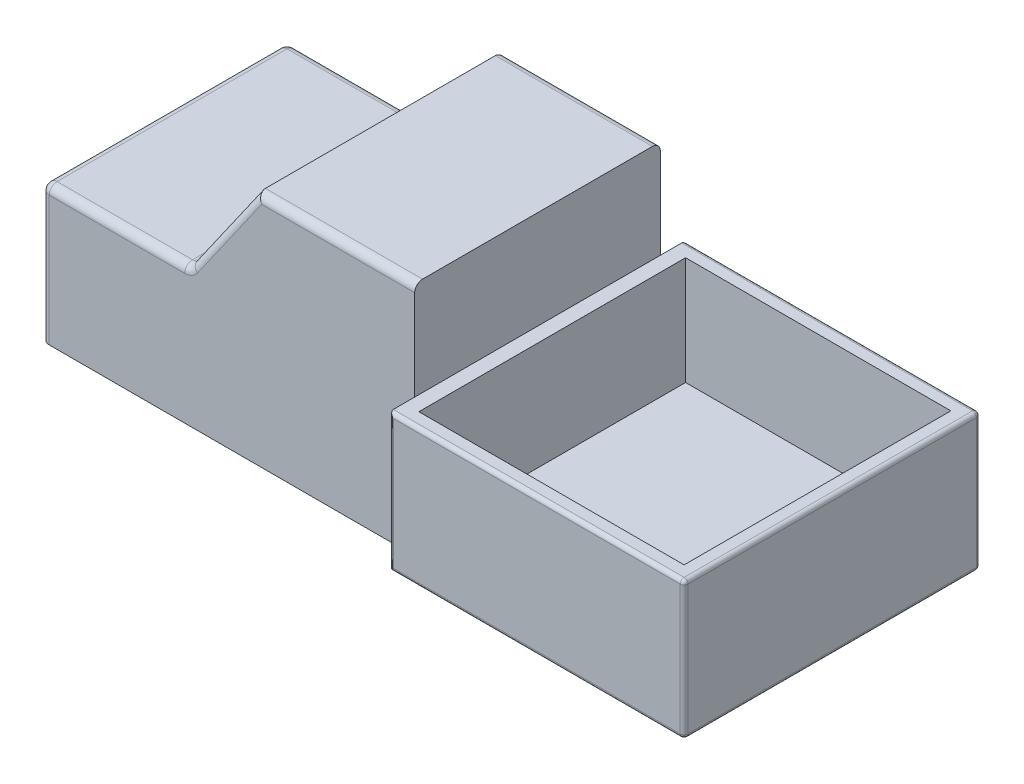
from build123d import *

# Parameters (mm, degrees)
BOSS_EXTRUDE1_DEPTH = 158.75
SKETCH6_W           = 330.2
SKETCH6_H           = 177.8
BOSS_EXTRUDE3_DEPTH = 32.7
FILLET4_R           = 10.16
SKETCH10_W          = 382.9
SKETCH10_H          = 177.8
BOSS_EXTRUDE5_DEPTH = 50.8
SKETCH11_W          = 342.9
SKETCH11_H          = 344.8
CUT_EXTRUDE2_DEPTH  = 139.7
FILLET13_R          = 5.08


with BuildPart() as part:
    # Sketch1 → Boss-Extrude1 (new, symmetric)
    with BuildSketch(Plane.XY):
        Polygon((-406.4, 88.9), (-406.4, -88.9), (406.4, -88.9), (406.4, 88.9), (76.2, 88.9), (76.2, 215.9), (-126.973642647, 215.9), (-215.9, 88.9), align=None)
    extrude(amount=BOSS_EXTRUDE1_DEPTH, both=True)

    # Sketch6 → Boss-Extrude3 (add)
    with BuildSketch(Plane.XY.offset(158.75)):
        with Locations((241.3, 0)):
            Rectangle(SKETCH6_W, SKETCH6_H)
    boss_extrude3 = extrude(amount=BOSS_EXTRUDE3_DEPTH)

    # Mirror2: Boss-Extrude3 across plane
    add(boss_extrude3.mirror(Plane.XY))

    # Fillet4
    fillet4_edges = [part.edges().sort_by_distance(p)[0] for p in [
        (-406.4, 0, -158.75),
        (-311.15, 88.9, -158.75),
        (-215.9, 88.9, 0),
        (-406.4, 88.9, 0),
        (-25.386821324, 215.9, 158.75),
        (-171.436821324, 152.4, 158.75),
        (-311.15, 88.9, 158.75),
        (-171.436821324, 152.4, -158.75),
        (-406.4, 0, 158.75),
        (-25.386821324, 215.9, -158.75),
    ]]
    fillet(fillet4_edges, radius=FILLET4_R)

    # Sketch10 → Boss-Extrude5 (add)
    with BuildSketch(Plane(origin=(406.4, 0, 0), x_dir=(0, 0, -1), z_dir=(1, 0, 0))):
        Rectangle(SKETCH10_W, SKETCH10_H)
    extrude(amount=BOSS_EXTRUDE5_DEPTH)

    # Sketch11 → Cut-Extrude2 (cut)
    with BuildSketch(Plane(origin=(0, 88.9, 0), x_dir=(1, 0, 0), z_dir=(0, 1, 0))):
        with Locations((266.7, 0)):
            Rectangle(SKETCH11_W, SKETCH11_H)
    extrude(amount=-CUT_EXTRUDE2_DEPTH, mode=Mode.SUBTRACT)

    # Fillet13
    fillet13_edges = [part.edges().sort_by_distance(p)[0] for p in [
        (76.2, 0, 191.45),
        (266.7, -88.9, 191.45),
        (266.7, 88.9, 191.45),
        (76.2, 0, -191.45),
        (266.7, 88.9, -191.45),
        (266.7, -88.9, -191.45),
        (457.2, 0, 191.45),
        (457.2, -88.9, 0),
        (457.2, 0, -191.45),
        (457.2, 88.9, 0),
    ]]
    fillet(fillet13_edges, radius=FILLET13_R)


solid = part.part
